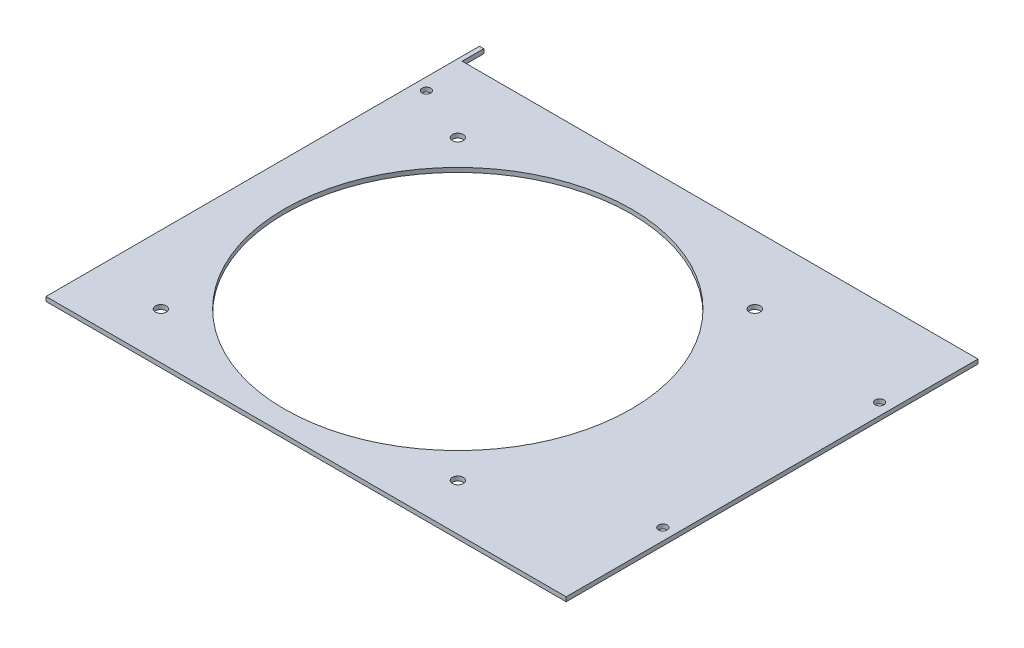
ISO-10303-21;
HEADER;
FILE_DESCRIPTION(('STEP AP214'),'2;1');
FILE_NAME('part.step','',(''),(''),'','','');
FILE_SCHEMA(('AUTOMOTIVE_DESIGN { 1 0 10303 214 1 1 1 1 }'));
ENDSEC;
DATA;
#1=APPLICATION_CONTEXT('core data for automotive mechanical design processes');
#2=APPLICATION_PROTOCOL_DEFINITION('international standard','automotive_design',2000,#1);
#3=PRODUCT_CONTEXT('',#1,'mechanical');
#4=PRODUCT('Part','Part','',(#3));
#5=PRODUCT_RELATED_PRODUCT_CATEGORY('part','',(#4));
#6=PRODUCT_DEFINITION_FORMATION('','',#4);
#7=PRODUCT_DEFINITION_CONTEXT('part definition',#1,'design');
#8=PRODUCT_DEFINITION('design','',#6,#7);
#9=PRODUCT_DEFINITION_SHAPE('','',#8);
#10=(LENGTH_UNIT() NAMED_UNIT(*) SI_UNIT(.MILLI.,.METRE.));
#11=(NAMED_UNIT(*) PLANE_ANGLE_UNIT() SI_UNIT($,.RADIAN.));
#12=(NAMED_UNIT(*) SI_UNIT($,.STERADIAN.) SOLID_ANGLE_UNIT());
#13=UNCERTAINTY_MEASURE_WITH_UNIT(LENGTH_MEASURE(1.E-05),#10,'distance_accuracy_value','');
#14=(GEOMETRIC_REPRESENTATION_CONTEXT(3) GLOBAL_UNCERTAINTY_ASSIGNED_CONTEXT((#13)) GLOBAL_UNIT_ASSIGNED_CONTEXT((#10,
#11,#12)) REPRESENTATION_CONTEXT('',''));
#15=CARTESIAN_POINT('',(0.,0.,0.));
#16=DIRECTION('',(0.,0.,1.));
#17=DIRECTION('',(1.,0.,0.));
#18=AXIS2_PLACEMENT_3D('',#15,#16,#17);
#19=CARTESIAN_POINT('',(0.,2.54,-34.5045662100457));
#20=DIRECTION('',(0.,0.,1.));
#21=DIRECTION('',(1.,0.,0.));
#22=AXIS2_PLACEMENT_3D('',#19,#20,#21);
#23=PLANE('',#22);
#24=DIRECTION('',(-1.,0.,0.));
#25=VECTOR('',#24,1.);
#26=CARTESIAN_POINT('',(0.,2.54,-34.5045662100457));
#27=LINE('',#26,#25);
#28=CARTESIAN_POINT('',(-251.46,2.54,-34.5045662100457));
#29=VERTEX_POINT('',#28);
#30=CARTESIAN_POINT('',(-254.,2.54,-34.5045662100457));
#31=VERTEX_POINT('',#30);
#32=EDGE_CURVE('E202',#29,#31,#27,.T.);
#33=ORIENTED_EDGE('',*,*,#32,.F.);
#34=DIRECTION('',(0.,1.,0.));
#35=VECTOR('',#34,1.);
#36=CARTESIAN_POINT('',(-251.46,-73.66,-34.5045662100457));
#37=LINE('',#36,#35);
#38=CARTESIAN_POINT('',(-251.46,0.,-34.5045662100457));
#39=VERTEX_POINT('',#38);
#40=EDGE_CURVE('E162',#39,#29,#37,.T.);
#41=ORIENTED_EDGE('',*,*,#40,.F.);
#42=DIRECTION('',(-1.,0.,0.));
#43=VECTOR('',#42,1.);
#44=CARTESIAN_POINT('',(0.,0.,-34.5045662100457));
#45=LINE('',#44,#43);
#46=CARTESIAN_POINT('',(-254.,0.,-34.5045662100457));
#47=VERTEX_POINT('',#46);
#48=EDGE_CURVE('E99',#39,#47,#45,.T.);
#49=ORIENTED_EDGE('',*,*,#48,.T.);
#50=DIRECTION('',(0.,-1.,0.));
#51=VECTOR('',#50,1.);
#52=CARTESIAN_POINT('',(-254.,2.54,-34.5045662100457));
#53=LINE('',#52,#51);
#54=EDGE_CURVE('E140',#31,#47,#53,.T.);
#55=ORIENTED_EDGE('',*,*,#54,.F.);
#56=EDGE_LOOP('',(#33,#41,#49,#55));
#57=FACE_BOUND('',#56,.T.);
#58=ADVANCED_FACE('F77',(#57),#23,.F.);
#59=CARTESIAN_POINT('',(-254.,2.54,219.495433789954));
#60=DIRECTION('',(1.,0.,0.));
#61=DIRECTION('',(0.,0.,-1.));
#62=AXIS2_PLACEMENT_3D('',#59,#60,#61);
#63=PLANE('',#62);
#64=DIRECTION('',(0.,0.,1.));
#65=VECTOR('',#64,1.);
#66=CARTESIAN_POINT('',(-254.,2.54,219.495433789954));
#67=LINE('',#66,#65);
#68=CARTESIAN_POINT('',(-254.,2.54,219.495433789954));
#69=VERTEX_POINT('',#68);
#70=EDGE_CURVE('E175',#31,#69,#67,.T.);
#71=ORIENTED_EDGE('',*,*,#70,.F.);
#72=ORIENTED_EDGE('',*,*,#54,.T.);
#73=DIRECTION('',(0.,0.,1.));
#74=VECTOR('',#73,1.);
#75=CARTESIAN_POINT('',(-254.,0.,219.495433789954));
#76=LINE('',#75,#74);
#77=CARTESIAN_POINT('',(-254.,0.,219.495433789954));
#78=VERTEX_POINT('',#77);
#79=EDGE_CURVE('E206',#47,#78,#76,.T.);
#80=ORIENTED_EDGE('',*,*,#79,.T.);
#81=DIRECTION('',(0.,-1.,0.));
#82=VECTOR('',#81,1.);
#83=CARTESIAN_POINT('',(-254.,2.54,219.495433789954));
#84=LINE('',#83,#82);
#85=EDGE_CURVE('E91',#69,#78,#84,.T.);
#86=ORIENTED_EDGE('',*,*,#85,.F.);
#87=EDGE_LOOP('',(#71,#72,#80,#86));
#88=FACE_BOUND('',#87,.T.);
#89=ADVANCED_FACE('F251',(#88),#63,.F.);
#90=CARTESIAN_POINT('',(0.,2.54,219.495433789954));
#91=DIRECTION('',(0.,0.,-1.));
#92=DIRECTION('',(-1.,0.,0.));
#93=AXIS2_PLACEMENT_3D('',#90,#91,#92);
#94=PLANE('',#93);
#95=DIRECTION('',(1.,0.,0.));
#96=VECTOR('',#95,1.);
#97=CARTESIAN_POINT('',(0.,0.,219.495433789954));
#98=LINE('',#97,#96);
#99=CARTESIAN_POINT('',(50.8000000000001,0.,219.495433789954));
#100=VERTEX_POINT('',#99);
#101=EDGE_CURVE('E204',#78,#100,#98,.T.);
#102=ORIENTED_EDGE('',*,*,#101,.T.);
#103=DIRECTION('',(0.,1.,0.));
#104=VECTOR('',#103,1.);
#105=CARTESIAN_POINT('',(50.8000000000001,0.,219.495433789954));
#106=LINE('',#105,#104);
#107=CARTESIAN_POINT('',(50.8000000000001,2.54,219.495433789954));
#108=VERTEX_POINT('',#107);
#109=EDGE_CURVE('E148',#100,#108,#106,.T.);
#110=ORIENTED_EDGE('',*,*,#109,.T.);
#111=DIRECTION('',(1.,0.,0.));
#112=VECTOR('',#111,1.);
#113=CARTESIAN_POINT('',(0.,2.54,219.495433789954));
#114=LINE('',#113,#112);
#115=EDGE_CURVE('E172',#69,#108,#114,.T.);
#116=ORIENTED_EDGE('',*,*,#115,.F.);
#117=ORIENTED_EDGE('',*,*,#85,.T.);
#118=EDGE_LOOP('',(#102,#110,#116,#117));
#119=FACE_BOUND('',#118,.T.);
#120=ADVANCED_FACE('F242',(#119),#94,.F.);
#121=CARTESIAN_POINT('',(-247.015,60.96,3.59543378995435));
#122=DIRECTION('',(0.,-1.,0.));
#123=DIRECTION('',(0.,0.,-1.));
#124=AXIS2_PLACEMENT_3D('',#121,#122,#123);
#125=CYLINDRICAL_SURFACE('',#124,2.53999999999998);
#126=CARTESIAN_POINT('',(-247.015,0.,3.59543378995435));
#127=DIRECTION('',(0.,1.,0.));
#128=DIRECTION('',(0.,0.,1.));
#129=AXIS2_PLACEMENT_3D('',#126,#127,#128);
#130=CIRCLE('',#129,2.53999999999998);
#131=CARTESIAN_POINT('',(-247.015,0.,1.05543378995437));
#132=VERTEX_POINT('',#131);
#133=EDGE_CURVE('E183',#132,#132,#130,.T.);
#134=CARTESIAN_POINT('',(-247.015,2.54,3.59543378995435));
#135=DIRECTION('',(0.,1.,0.));
#136=DIRECTION('',(0.,0.,1.));
#137=AXIS2_PLACEMENT_3D('',#134,#135,#136);
#138=CIRCLE('',#137,2.53999999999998);
#139=CARTESIAN_POINT('',(-247.015,2.54,1.05543378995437));
#140=VERTEX_POINT('',#139);
#141=EDGE_CURVE('E169',#140,#140,#138,.T.);
#142=CARTESIAN_POINT('',(-247.015,0.,1.05543378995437));
#143=CARTESIAN_POINT('',(-247.015,0.0264583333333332,1.05543378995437));
#144=CARTESIAN_POINT('',(-247.015,0.0529166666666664,1.05543378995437));
#145=CARTESIAN_POINT('',(-247.015,0.105833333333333,1.05543378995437));
#146=CARTESIAN_POINT('',(-247.015,0.132291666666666,1.05543378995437));
#147=CARTESIAN_POINT('',(-247.015,0.185208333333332,1.05543378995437));
#148=CARTESIAN_POINT('',(-247.015,0.211666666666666,1.05543378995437));
#149=CARTESIAN_POINT('',(-247.015,0.264583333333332,1.05543378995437));
#150=CARTESIAN_POINT('',(-247.015,0.291041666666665,1.05543378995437));
#151=CARTESIAN_POINT('',(-247.015,0.343958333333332,1.05543378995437));
#152=CARTESIAN_POINT('',(-247.015,0.370416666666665,1.05543378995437));
#153=CARTESIAN_POINT('',(-247.015,0.423333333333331,1.05543378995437));
#154=CARTESIAN_POINT('',(-247.015,0.449791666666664,1.05543378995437));
#155=CARTESIAN_POINT('',(-247.015,0.502708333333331,1.05543378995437));
#156=CARTESIAN_POINT('',(-247.015,0.529166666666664,1.05543378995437));
#157=CARTESIAN_POINT('',(-247.015,0.58208333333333,1.05543378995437));
#158=CARTESIAN_POINT('',(-247.015,0.608541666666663,1.05543378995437));
#159=CARTESIAN_POINT('',(-247.015,0.661458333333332,1.05543378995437));
#160=CARTESIAN_POINT('',(-247.015,0.687916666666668,1.05543378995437));
#161=CARTESIAN_POINT('',(-247.015,0.740833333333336,1.05543378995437));
#162=CARTESIAN_POINT('',(-247.015,0.76729166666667,1.05543378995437));
#163=CARTESIAN_POINT('',(-247.015,0.820208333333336,1.05543378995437));
#164=CARTESIAN_POINT('',(-247.015,0.846666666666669,1.05543378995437));
#165=CARTESIAN_POINT('',(-247.015,0.899583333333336,1.05543378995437));
#166=CARTESIAN_POINT('',(-247.015,0.926041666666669,1.05543378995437));
#167=CARTESIAN_POINT('',(-247.015,0.978958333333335,1.05543378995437));
#168=CARTESIAN_POINT('',(-247.015,1.00541666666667,1.05543378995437));
#169=CARTESIAN_POINT('',(-247.015,1.05833333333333,1.05543378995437));
#170=CARTESIAN_POINT('',(-247.015,1.08479166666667,1.05543378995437));
#171=CARTESIAN_POINT('',(-247.015,1.13770833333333,1.05543378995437));
#172=CARTESIAN_POINT('',(-247.015,1.16416666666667,1.05543378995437));
#173=CARTESIAN_POINT('',(-247.015,1.21708333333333,1.05543378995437));
#174=CARTESIAN_POINT('',(-247.015,1.24354166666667,1.05543378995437));
#175=CARTESIAN_POINT('',(-247.015,1.29645833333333,1.05543378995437));
#176=CARTESIAN_POINT('',(-247.015,1.32291666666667,1.05543378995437));
#177=CARTESIAN_POINT('',(-247.015,1.37583333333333,1.05543378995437));
#178=CARTESIAN_POINT('',(-247.015,1.40229166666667,1.05543378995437));
#179=CARTESIAN_POINT('',(-247.015,1.45520833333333,1.05543378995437));
#180=CARTESIAN_POINT('',(-247.015,1.48166666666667,1.05543378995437));
#181=CARTESIAN_POINT('',(-247.015,1.53458333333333,1.05543378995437));
#182=CARTESIAN_POINT('',(-247.015,1.56104166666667,1.05543378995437));
#183=CARTESIAN_POINT('',(-247.015,1.61395833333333,1.05543378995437));
#184=CARTESIAN_POINT('',(-247.015,1.64041666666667,1.05543378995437));
#185=CARTESIAN_POINT('',(-247.015,1.69333333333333,1.05543378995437));
#186=CARTESIAN_POINT('',(-247.015,1.71979166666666,1.05543378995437));
#187=CARTESIAN_POINT('',(-247.015,1.77270833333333,1.05543378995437));
#188=CARTESIAN_POINT('',(-247.015,1.79916666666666,1.05543378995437));
#189=CARTESIAN_POINT('',(-247.015,1.85208333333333,1.05543378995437));
#190=CARTESIAN_POINT('',(-247.015,1.87854166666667,1.05543378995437));
#191=CARTESIAN_POINT('',(-247.015,1.93145833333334,1.05543378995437));
#192=CARTESIAN_POINT('',(-247.015,1.95791666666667,1.05543378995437));
#193=CARTESIAN_POINT('',(-247.015,2.01083333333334,1.05543378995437));
#194=CARTESIAN_POINT('',(-247.015,2.03729166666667,1.05543378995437));
#195=CARTESIAN_POINT('',(-247.015,2.09020833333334,1.05543378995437));
#196=CARTESIAN_POINT('',(-247.015,2.11666666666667,1.05543378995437));
#197=CARTESIAN_POINT('',(-247.015,2.16958333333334,1.05543378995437));
#198=CARTESIAN_POINT('',(-247.015,2.19604166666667,1.05543378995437));
#199=CARTESIAN_POINT('',(-247.015,2.24895833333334,1.05543378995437));
#200=CARTESIAN_POINT('',(-247.015,2.27541666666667,1.05543378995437));
#201=CARTESIAN_POINT('',(-247.015,2.32833333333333,1.05543378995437));
#202=CARTESIAN_POINT('',(-247.015,2.35479166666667,1.05543378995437));
#203=CARTESIAN_POINT('',(-247.015,2.40770833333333,1.05543378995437));
#204=CARTESIAN_POINT('',(-247.015,2.43416666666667,1.05543378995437));
#205=CARTESIAN_POINT('',(-247.015,2.48708333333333,1.05543378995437));
#206=CARTESIAN_POINT('',(-247.015,2.51354166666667,1.05543378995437));
#207=CARTESIAN_POINT('',(-247.015,2.54,1.05543378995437));
#208=B_SPLINE_CURVE_WITH_KNOTS('',3,(#142,#143,#144,#145,#146,#147,#148,#149,#150,#151,#152,
#153,#154,#155,#156,#157,#158,#159,#160,#161,#162,#163,#164,#165,#166,#167,#168,#169,#170,#171,
#172,#173,#174,#175,#176,#177,#178,#179,#180,#181,#182,#183,#184,#185,#186,#187,#188,#189,#190,
#191,#192,#193,#194,#195,#196,#197,#198,#199,#200,#201,#202,#203,#204,#205,#206,#207),
.UNSPECIFIED.,.F.,.F.,(4,2,2,2,2,2,2,2,2,2,2,2,2,2,2,2,2,2,2,2,2,2,2,2,2,2,2,2,2,2,2,2,4),(0.,
0.0793749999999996,0.158749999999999,0.238124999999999,0.317499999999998,0.396874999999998,
0.476249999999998,0.555624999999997,0.634999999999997,0.714375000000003,0.793750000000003,
0.873125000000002,0.952500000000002,1.031875,1.11125,1.190625,1.27,1.349375,1.42875,1.508125,
1.5875,1.666875,1.74625,1.825625,1.905,1.984375,2.06375,2.143125,2.2225,2.301875,2.38125,
2.460625,2.54),.UNSPECIFIED.);
#209=EDGE_CURVE('BSEAM239',#132,#140,#208,.T.);
#210=ORIENTED_EDGE('',*,*,#133,.F.);
#211=ORIENTED_EDGE('',*,*,#141,.T.);
#212=ORIENTED_EDGE('',*,*,#209,.T.);
#213=ORIENTED_EDGE('',*,*,#209,.F.);
#214=EDGE_LOOP('',(#210,#212,#211,#213));
#215=FACE_BOUND('',#214,.T.);
#216=ADVANCED_FACE('F239',(#215),#125,.F.);
#217=CARTESIAN_POINT('',(43.942,60.96,28.9954337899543));
#218=DIRECTION('',(0.,-1.,0.));
#219=DIRECTION('',(0.,0.,-1.));
#220=AXIS2_PLACEMENT_3D('',#217,#218,#219);
#221=CYLINDRICAL_SURFACE('',#220,2.54);
#222=CARTESIAN_POINT('',(43.942,0.,28.9954337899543));
#223=DIRECTION('',(0.,1.,0.));
#224=DIRECTION('',(0.,0.,1.));
#225=AXIS2_PLACEMENT_3D('',#222,#223,#224);
#226=CIRCLE('',#225,2.54);
#227=CARTESIAN_POINT('',(43.942,0.,26.4554337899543));
#228=VERTEX_POINT('',#227);
#229=EDGE_CURVE('E180',#228,#228,#226,.T.);
#230=CARTESIAN_POINT('',(43.942,2.54,28.9954337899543));
#231=DIRECTION('',(0.,1.,0.));
#232=DIRECTION('',(0.,0.,1.));
#233=AXIS2_PLACEMENT_3D('',#230,#231,#232);
#234=CIRCLE('',#233,2.54);
#235=CARTESIAN_POINT('',(43.942,2.54,26.4554337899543));
#236=VERTEX_POINT('',#235);
#237=EDGE_CURVE('E166',#236,#236,#234,.T.);
#238=CARTESIAN_POINT('',(43.942,0.,26.4554337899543));
#239=CARTESIAN_POINT('',(43.942,0.0264583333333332,26.4554337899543));
#240=CARTESIAN_POINT('',(43.942,0.0529166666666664,26.4554337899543));
#241=CARTESIAN_POINT('',(43.942,0.105833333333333,26.4554337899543));
#242=CARTESIAN_POINT('',(43.942,0.132291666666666,26.4554337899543));
#243=CARTESIAN_POINT('',(43.942,0.185208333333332,26.4554337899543));
#244=CARTESIAN_POINT('',(43.942,0.211666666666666,26.4554337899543));
#245=CARTESIAN_POINT('',(43.942,0.264583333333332,26.4554337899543));
#246=CARTESIAN_POINT('',(43.942,0.291041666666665,26.4554337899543));
#247=CARTESIAN_POINT('',(43.942,0.343958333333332,26.4554337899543));
#248=CARTESIAN_POINT('',(43.942,0.370416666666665,26.4554337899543));
#249=CARTESIAN_POINT('',(43.942,0.423333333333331,26.4554337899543));
#250=CARTESIAN_POINT('',(43.942,0.449791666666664,26.4554337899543));
#251=CARTESIAN_POINT('',(43.942,0.502708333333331,26.4554337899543));
#252=CARTESIAN_POINT('',(43.942,0.529166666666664,26.4554337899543));
#253=CARTESIAN_POINT('',(43.942,0.58208333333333,26.4554337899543));
#254=CARTESIAN_POINT('',(43.942,0.608541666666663,26.4554337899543));
#255=CARTESIAN_POINT('',(43.942,0.661458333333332,26.4554337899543));
#256=CARTESIAN_POINT('',(43.942,0.687916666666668,26.4554337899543));
#257=CARTESIAN_POINT('',(43.942,0.740833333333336,26.4554337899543));
#258=CARTESIAN_POINT('',(43.942,0.76729166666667,26.4554337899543));
#259=CARTESIAN_POINT('',(43.942,0.820208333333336,26.4554337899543));
#260=CARTESIAN_POINT('',(43.942,0.846666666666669,26.4554337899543));
#261=CARTESIAN_POINT('',(43.942,0.899583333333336,26.4554337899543));
#262=CARTESIAN_POINT('',(43.942,0.926041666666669,26.4554337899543));
#263=CARTESIAN_POINT('',(43.942,0.978958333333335,26.4554337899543));
#264=CARTESIAN_POINT('',(43.942,1.00541666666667,26.4554337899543));
#265=CARTESIAN_POINT('',(43.942,1.05833333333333,26.4554337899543));
#266=CARTESIAN_POINT('',(43.942,1.08479166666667,26.4554337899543));
#267=CARTESIAN_POINT('',(43.942,1.13770833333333,26.4554337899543));
#268=CARTESIAN_POINT('',(43.942,1.16416666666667,26.4554337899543));
#269=CARTESIAN_POINT('',(43.942,1.21708333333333,26.4554337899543));
#270=CARTESIAN_POINT('',(43.942,1.24354166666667,26.4554337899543));
#271=CARTESIAN_POINT('',(43.942,1.29645833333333,26.4554337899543));
#272=CARTESIAN_POINT('',(43.942,1.32291666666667,26.4554337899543));
#273=CARTESIAN_POINT('',(43.942,1.37583333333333,26.4554337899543));
#274=CARTESIAN_POINT('',(43.942,1.40229166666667,26.4554337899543));
#275=CARTESIAN_POINT('',(43.942,1.45520833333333,26.4554337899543));
#276=CARTESIAN_POINT('',(43.942,1.48166666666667,26.4554337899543));
#277=CARTESIAN_POINT('',(43.942,1.53458333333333,26.4554337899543));
#278=CARTESIAN_POINT('',(43.942,1.56104166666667,26.4554337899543));
#279=CARTESIAN_POINT('',(43.942,1.61395833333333,26.4554337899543));
#280=CARTESIAN_POINT('',(43.942,1.64041666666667,26.4554337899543));
#281=CARTESIAN_POINT('',(43.942,1.69333333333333,26.4554337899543));
#282=CARTESIAN_POINT('',(43.942,1.71979166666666,26.4554337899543));
#283=CARTESIAN_POINT('',(43.942,1.77270833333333,26.4554337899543));
#284=CARTESIAN_POINT('',(43.942,1.79916666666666,26.4554337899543));
#285=CARTESIAN_POINT('',(43.942,1.85208333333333,26.4554337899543));
#286=CARTESIAN_POINT('',(43.942,1.87854166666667,26.4554337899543));
#287=CARTESIAN_POINT('',(43.942,1.93145833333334,26.4554337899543));
#288=CARTESIAN_POINT('',(43.942,1.95791666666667,26.4554337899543));
#289=CARTESIAN_POINT('',(43.942,2.01083333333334,26.4554337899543));
#290=CARTESIAN_POINT('',(43.942,2.03729166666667,26.4554337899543));
#291=CARTESIAN_POINT('',(43.942,2.09020833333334,26.4554337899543));
#292=CARTESIAN_POINT('',(43.942,2.11666666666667,26.4554337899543));
#293=CARTESIAN_POINT('',(43.942,2.16958333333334,26.4554337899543));
#294=CARTESIAN_POINT('',(43.942,2.19604166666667,26.4554337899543));
#295=CARTESIAN_POINT('',(43.942,2.24895833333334,26.4554337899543));
#296=CARTESIAN_POINT('',(43.942,2.27541666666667,26.4554337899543));
#297=CARTESIAN_POINT('',(43.942,2.32833333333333,26.4554337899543));
#298=CARTESIAN_POINT('',(43.942,2.35479166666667,26.4554337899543));
#299=CARTESIAN_POINT('',(43.942,2.40770833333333,26.4554337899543));
#300=CARTESIAN_POINT('',(43.942,2.43416666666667,26.4554337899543));
#301=CARTESIAN_POINT('',(43.942,2.48708333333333,26.4554337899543));
#302=CARTESIAN_POINT('',(43.942,2.51354166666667,26.4554337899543));
#303=CARTESIAN_POINT('',(43.942,2.54,26.4554337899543));
#304=B_SPLINE_CURVE_WITH_KNOTS('',3,(#238,#239,#240,#241,#242,#243,#244,#245,#246,#247,#248,
#249,#250,#251,#252,#253,#254,#255,#256,#257,#258,#259,#260,#261,#262,#263,#264,#265,#266,#267,
#268,#269,#270,#271,#272,#273,#274,#275,#276,#277,#278,#279,#280,#281,#282,#283,#284,#285,#286,
#287,#288,#289,#290,#291,#292,#293,#294,#295,#296,#297,#298,#299,#300,#301,#302,#303),
.UNSPECIFIED.,.F.,.F.,(4,2,2,2,2,2,2,2,2,2,2,2,2,2,2,2,2,2,2,2,2,2,2,2,2,2,2,2,2,2,2,2,4),(0.,
0.0793749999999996,0.158749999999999,0.238124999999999,0.317499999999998,0.396874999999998,
0.476249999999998,0.555624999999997,0.634999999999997,0.714375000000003,0.793750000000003,
0.873125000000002,0.952500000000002,1.031875,1.11125,1.190625,1.27,1.349375,1.42875,1.508125,
1.5875,1.666875,1.74625,1.825625,1.905,1.984375,2.06375,2.143125,2.2225,2.301875,2.38125,
2.460625,2.54),.UNSPECIFIED.);
#305=EDGE_CURVE('BSEAM241',#228,#236,#304,.T.);
#306=ORIENTED_EDGE('',*,*,#229,.F.);
#307=ORIENTED_EDGE('',*,*,#237,.T.);
#308=ORIENTED_EDGE('',*,*,#305,.T.);
#309=ORIENTED_EDGE('',*,*,#305,.F.);
#310=EDGE_LOOP('',(#306,#308,#307,#309));
#311=FACE_BOUND('',#310,.T.);
#312=ADVANCED_FACE('F241',(#311),#221,.F.);
#313=CARTESIAN_POINT('',(43.942,60.96,155.995433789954));
#314=DIRECTION('',(0.,-1.,0.));
#315=DIRECTION('',(0.,0.,-1.));
#316=AXIS2_PLACEMENT_3D('',#313,#314,#315);
#317=CYLINDRICAL_SURFACE('',#316,2.54000000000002);
#318=CARTESIAN_POINT('',(43.942,0.,155.995433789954));
#319=DIRECTION('',(0.,1.,0.));
#320=DIRECTION('',(0.,0.,1.));
#321=AXIS2_PLACEMENT_3D('',#318,#319,#320);
#322=CIRCLE('',#321,2.54000000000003);
#323=CARTESIAN_POINT('',(43.942,0.,153.455433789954));
#324=VERTEX_POINT('',#323);
#325=EDGE_CURVE('E177',#324,#324,#322,.T.);
#326=CARTESIAN_POINT('',(43.942,2.54,155.995433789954));
#327=DIRECTION('',(0.,1.,0.));
#328=DIRECTION('',(0.,0.,1.));
#329=AXIS2_PLACEMENT_3D('',#326,#327,#328);
#330=CIRCLE('',#329,2.54000000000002);
#331=CARTESIAN_POINT('',(43.942,2.54,153.455433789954));
#332=VERTEX_POINT('',#331);
#333=EDGE_CURVE('E164',#332,#332,#330,.T.);
#334=CARTESIAN_POINT('',(43.942,0.,153.455433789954));
#335=CARTESIAN_POINT('',(43.942,0.0264583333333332,153.455433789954));
#336=CARTESIAN_POINT('',(43.942,0.0529166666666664,153.455433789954));
#337=CARTESIAN_POINT('',(43.942,0.105833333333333,153.455433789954));
#338=CARTESIAN_POINT('',(43.942,0.132291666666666,153.455433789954));
#339=CARTESIAN_POINT('',(43.942,0.185208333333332,153.455433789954));
#340=CARTESIAN_POINT('',(43.942,0.211666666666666,153.455433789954));
#341=CARTESIAN_POINT('',(43.942,0.264583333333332,153.455433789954));
#342=CARTESIAN_POINT('',(43.942,0.291041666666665,153.455433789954));
#343=CARTESIAN_POINT('',(43.942,0.343958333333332,153.455433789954));
#344=CARTESIAN_POINT('',(43.942,0.370416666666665,153.455433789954));
#345=CARTESIAN_POINT('',(43.942,0.423333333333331,153.455433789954));
#346=CARTESIAN_POINT('',(43.942,0.449791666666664,153.455433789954));
#347=CARTESIAN_POINT('',(43.942,0.502708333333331,153.455433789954));
#348=CARTESIAN_POINT('',(43.942,0.529166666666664,153.455433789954));
#349=CARTESIAN_POINT('',(43.942,0.58208333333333,153.455433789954));
#350=CARTESIAN_POINT('',(43.942,0.608541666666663,153.455433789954));
#351=CARTESIAN_POINT('',(43.942,0.661458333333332,153.455433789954));
#352=CARTESIAN_POINT('',(43.942,0.687916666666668,153.455433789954));
#353=CARTESIAN_POINT('',(43.942,0.740833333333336,153.455433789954));
#354=CARTESIAN_POINT('',(43.942,0.76729166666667,153.455433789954));
#355=CARTESIAN_POINT('',(43.942,0.820208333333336,153.455433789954));
#356=CARTESIAN_POINT('',(43.942,0.846666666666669,153.455433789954));
#357=CARTESIAN_POINT('',(43.942,0.899583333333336,153.455433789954));
#358=CARTESIAN_POINT('',(43.942,0.926041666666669,153.455433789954));
#359=CARTESIAN_POINT('',(43.942,0.978958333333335,153.455433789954));
#360=CARTESIAN_POINT('',(43.942,1.00541666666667,153.455433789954));
#361=CARTESIAN_POINT('',(43.942,1.05833333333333,153.455433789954));
#362=CARTESIAN_POINT('',(43.942,1.08479166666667,153.455433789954));
#363=CARTESIAN_POINT('',(43.942,1.13770833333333,153.455433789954));
#364=CARTESIAN_POINT('',(43.942,1.16416666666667,153.455433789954));
#365=CARTESIAN_POINT('',(43.942,1.21708333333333,153.455433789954));
#366=CARTESIAN_POINT('',(43.942,1.24354166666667,153.455433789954));
#367=CARTESIAN_POINT('',(43.942,1.29645833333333,153.455433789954));
#368=CARTESIAN_POINT('',(43.942,1.32291666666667,153.455433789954));
#369=CARTESIAN_POINT('',(43.942,1.37583333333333,153.455433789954));
#370=CARTESIAN_POINT('',(43.942,1.40229166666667,153.455433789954));
#371=CARTESIAN_POINT('',(43.942,1.45520833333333,153.455433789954));
#372=CARTESIAN_POINT('',(43.942,1.48166666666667,153.455433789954));
#373=CARTESIAN_POINT('',(43.942,1.53458333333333,153.455433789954));
#374=CARTESIAN_POINT('',(43.942,1.56104166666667,153.455433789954));
#375=CARTESIAN_POINT('',(43.942,1.61395833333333,153.455433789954));
#376=CARTESIAN_POINT('',(43.942,1.64041666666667,153.455433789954));
#377=CARTESIAN_POINT('',(43.942,1.69333333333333,153.455433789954));
#378=CARTESIAN_POINT('',(43.942,1.71979166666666,153.455433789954));
#379=CARTESIAN_POINT('',(43.942,1.77270833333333,153.455433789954));
#380=CARTESIAN_POINT('',(43.942,1.79916666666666,153.455433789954));
#381=CARTESIAN_POINT('',(43.942,1.85208333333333,153.455433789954));
#382=CARTESIAN_POINT('',(43.942,1.87854166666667,153.455433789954));
#383=CARTESIAN_POINT('',(43.942,1.93145833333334,153.455433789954));
#384=CARTESIAN_POINT('',(43.942,1.95791666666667,153.455433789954));
#385=CARTESIAN_POINT('',(43.942,2.01083333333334,153.455433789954));
#386=CARTESIAN_POINT('',(43.942,2.03729166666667,153.455433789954));
#387=CARTESIAN_POINT('',(43.942,2.09020833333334,153.455433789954));
#388=CARTESIAN_POINT('',(43.942,2.11666666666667,153.455433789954));
#389=CARTESIAN_POINT('',(43.942,2.16958333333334,153.455433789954));
#390=CARTESIAN_POINT('',(43.942,2.19604166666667,153.455433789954));
#391=CARTESIAN_POINT('',(43.942,2.24895833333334,153.455433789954));
#392=CARTESIAN_POINT('',(43.942,2.27541666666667,153.455433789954));
#393=CARTESIAN_POINT('',(43.942,2.32833333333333,153.455433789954));
#394=CARTESIAN_POINT('',(43.942,2.35479166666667,153.455433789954));
#395=CARTESIAN_POINT('',(43.942,2.40770833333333,153.455433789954));
#396=CARTESIAN_POINT('',(43.942,2.43416666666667,153.455433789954));
#397=CARTESIAN_POINT('',(43.942,2.48708333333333,153.455433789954));
#398=CARTESIAN_POINT('',(43.942,2.51354166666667,153.455433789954));
#399=CARTESIAN_POINT('',(43.942,2.54,153.455433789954));
#400=B_SPLINE_CURVE_WITH_KNOTS('',3,(#334,#335,#336,#337,#338,#339,#340,#341,#342,#343,#344,
#345,#346,#347,#348,#349,#350,#351,#352,#353,#354,#355,#356,#357,#358,#359,#360,#361,#362,#363,
#364,#365,#366,#367,#368,#369,#370,#371,#372,#373,#374,#375,#376,#377,#378,#379,#380,#381,#382,
#383,#384,#385,#386,#387,#388,#389,#390,#391,#392,#393,#394,#395,#396,#397,#398,#399),
.UNSPECIFIED.,.F.,.F.,(4,2,2,2,2,2,2,2,2,2,2,2,2,2,2,2,2,2,2,2,2,2,2,2,2,2,2,2,2,2,2,2,4),(0.,
0.0793749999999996,0.158749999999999,0.238124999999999,0.317499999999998,0.396874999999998,
0.476249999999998,0.555624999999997,0.634999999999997,0.714375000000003,0.793750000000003,
0.873125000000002,0.952500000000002,1.031875,1.11125,1.190625,1.27,1.349375,1.42875,1.508125,
1.5875,1.666875,1.74625,1.825625,1.905,1.984375,2.06375,2.143125,2.2225,2.301875,2.38125,
2.460625,2.54),.UNSPECIFIED.);
#401=EDGE_CURVE('BSEAM228',#324,#332,#400,.T.);
#402=ORIENTED_EDGE('',*,*,#325,.F.);
#403=ORIENTED_EDGE('',*,*,#333,.T.);
#404=ORIENTED_EDGE('',*,*,#401,.T.);
#405=ORIENTED_EDGE('',*,*,#401,.F.);
#406=EDGE_LOOP('',(#402,#404,#403,#405));
#407=FACE_BOUND('',#406,.T.);
#408=ADVANCED_FACE('F228',(#407),#317,.F.);
#409=CARTESIAN_POINT('',(0.,2.54,0.));
#410=DIRECTION('',(0.,1.,0.));
#411=DIRECTION('',(0.,0.,1.));
#412=AXIS2_PLACEMENT_3D('',#409,#410,#411);
#413=PLANE('',#412);
#414=DIRECTION('',(0.,0.,1.));
#415=VECTOR('',#414,1.);
#416=CARTESIAN_POINT('',(50.8,2.54,-21.8045662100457));
#417=LINE('',#416,#415);
#418=CARTESIAN_POINT('',(50.8,2.54,-21.8045662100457));
#419=VERTEX_POINT('',#418);
#420=EDGE_CURVE('E152',#419,#108,#417,.T.);
#421=ORIENTED_EDGE('',*,*,#420,.F.);
#422=DIRECTION('',(1.,0.,0.));
#423=VECTOR('',#422,1.);
#424=CARTESIAN_POINT('',(-251.46,2.54,-21.8045662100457));
#425=LINE('',#424,#423);
#426=CARTESIAN_POINT('',(-251.46,2.54,-21.8045662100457));
#427=VERTEX_POINT('',#426);
#428=EDGE_CURVE('E145',#427,#419,#425,.T.);
#429=ORIENTED_EDGE('',*,*,#428,.F.);
#430=DIRECTION('',(0.,0.,1.));
#431=VECTOR('',#430,1.);
#432=CARTESIAN_POINT('',(-251.46,2.54,-34.5045662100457));
#433=LINE('',#432,#431);
#434=EDGE_CURVE('E156',#29,#427,#433,.T.);
#435=ORIENTED_EDGE('',*,*,#434,.F.);
#436=ORIENTED_EDGE('',*,*,#32,.T.);
#437=ORIENTED_EDGE('',*,*,#70,.T.);
#438=ORIENTED_EDGE('',*,*,#115,.T.);
#439=EDGE_LOOP('',(#421,#429,#435,#436,#437,#438));
#440=FACE_BOUND('',#439,.T.);
#441=CARTESIAN_POINT('',(-213.995,2.54,192.190433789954));
#442=DIRECTION('',(0.,1.,0.));
#443=DIRECTION('',(0.,0.,1.));
#444=AXIS2_PLACEMENT_3D('',#441,#442,#443);
#445=CIRCLE('',#444,3.17499999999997);
#446=CARTESIAN_POINT('',(-213.995,2.54,195.365433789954));
#447=VERTEX_POINT('',#446);
#448=EDGE_CURVE('E186',#447,#447,#445,.T.);
#449=ORIENTED_EDGE('',*,*,#448,.F.);
#450=EDGE_LOOP('',(#449));
#451=FACE_BOUND('',#450,.T.);
#452=CARTESIAN_POINT('',(-40.005,2.54,192.190433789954));
#453=DIRECTION('',(0.,1.,0.));
#454=DIRECTION('',(0.,0.,1.));
#455=AXIS2_PLACEMENT_3D('',#452,#453,#454);
#456=CIRCLE('',#455,3.175);
#457=CARTESIAN_POINT('',(-40.005,2.54,195.365433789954));
#458=VERTEX_POINT('',#457);
#459=EDGE_CURVE('E194',#458,#458,#456,.T.);
#460=ORIENTED_EDGE('',*,*,#459,.F.);
#461=EDGE_LOOP('',(#460));
#462=FACE_BOUND('',#461,.T.);
#463=CARTESIAN_POINT('',(-40.0050000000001,2.54,18.2004337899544));
#464=DIRECTION('',(0.,1.,0.));
#465=DIRECTION('',(0.,0.,1.));
#466=AXIS2_PLACEMENT_3D('',#463,#464,#465);
#467=CIRCLE('',#466,3.175);
#468=CARTESIAN_POINT('',(-40.0050000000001,2.54,21.3754337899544));
#469=VERTEX_POINT('',#468);
#470=EDGE_CURVE('E191',#469,#469,#467,.T.);
#471=ORIENTED_EDGE('',*,*,#470,.F.);
#472=EDGE_LOOP('',(#471));
#473=FACE_BOUND('',#472,.T.);
#474=CARTESIAN_POINT('',(-213.995,2.54,18.2004337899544));
#475=DIRECTION('',(0.,1.,0.));
#476=DIRECTION('',(0.,0.,1.));
#477=AXIS2_PLACEMENT_3D('',#474,#475,#476);
#478=CIRCLE('',#477,3.175);
#479=CARTESIAN_POINT('',(-213.995,2.54,21.3754337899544));
#480=VERTEX_POINT('',#479);
#481=EDGE_CURVE('E187',#480,#480,#478,.T.);
#482=ORIENTED_EDGE('',*,*,#481,.F.);
#483=EDGE_LOOP('',(#482));
#484=FACE_BOUND('',#483,.T.);
#485=CARTESIAN_POINT('',(-127.,2.54,105.195433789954));
#486=DIRECTION('',(0.,1.,0.));
#487=DIRECTION('',(0.,0.,1.));
#488=AXIS2_PLACEMENT_3D('',#485,#486,#487);
#489=CIRCLE('',#488,101.6);
#490=CARTESIAN_POINT('',(-127.,2.54,206.795433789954));
#491=VERTEX_POINT('',#490);
#492=EDGE_CURVE('E190',#491,#491,#489,.T.);
#493=ORIENTED_EDGE('',*,*,#492,.F.);
#494=EDGE_LOOP('',(#493));
#495=FACE_BOUND('',#494,.T.);
#496=ORIENTED_EDGE('',*,*,#333,.F.);
#497=EDGE_LOOP('',(#496));
#498=FACE_BOUND('',#497,.T.);
#499=ORIENTED_EDGE('',*,*,#237,.F.);
#500=EDGE_LOOP('',(#499));
#501=FACE_BOUND('',#500,.T.);
#502=ORIENTED_EDGE('',*,*,#141,.F.);
#503=EDGE_LOOP('',(#502));
#504=FACE_BOUND('',#503,.T.);
#505=ADVANCED_FACE('F230',(#440,#451,#462,#473,#484,#495,#498,#501,#504),#413,.T.);
#506=CARTESIAN_POINT('',(0.,0.,0.));
#507=DIRECTION('',(0.,1.,0.));
#508=DIRECTION('',(0.,0.,1.));
#509=AXIS2_PLACEMENT_3D('',#506,#507,#508);
#510=PLANE('',#509);
#511=DIRECTION('',(1.,0.,0.));
#512=VECTOR('',#511,1.);
#513=CARTESIAN_POINT('',(0.,0.,-21.8045662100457));
#514=LINE('',#513,#512);
#515=CARTESIAN_POINT('',(-251.46,0.,-21.8045662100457));
#516=VERTEX_POINT('',#515);
#517=CARTESIAN_POINT('',(50.8,0.,-21.8045662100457));
#518=VERTEX_POINT('',#517);
#519=EDGE_CURVE('E84',#516,#518,#514,.T.);
#520=ORIENTED_EDGE('',*,*,#519,.T.);
#521=DIRECTION('',(0.,0.,1.));
#522=VECTOR('',#521,1.);
#523=CARTESIAN_POINT('',(50.8,0.,-21.8045662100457));
#524=LINE('',#523,#522);
#525=EDGE_CURVE('E137',#518,#100,#524,.T.);
#526=ORIENTED_EDGE('',*,*,#525,.T.);
#527=ORIENTED_EDGE('',*,*,#101,.F.);
#528=ORIENTED_EDGE('',*,*,#79,.F.);
#529=ORIENTED_EDGE('',*,*,#48,.F.);
#530=DIRECTION('',(0.,0.,1.));
#531=VECTOR('',#530,1.);
#532=CARTESIAN_POINT('',(-251.46,0.,0.));
#533=LINE('',#532,#531);
#534=EDGE_CURVE('E12',#39,#516,#533,.T.);
#535=ORIENTED_EDGE('',*,*,#534,.T.);
#536=EDGE_LOOP('',(#520,#526,#527,#528,#529,#535));
#537=FACE_BOUND('',#536,.T.);
#538=ORIENTED_EDGE('',*,*,#133,.T.);
#539=EDGE_LOOP('',(#538));
#540=FACE_BOUND('',#539,.T.);
#541=ORIENTED_EDGE('',*,*,#229,.T.);
#542=EDGE_LOOP('',(#541));
#543=FACE_BOUND('',#542,.T.);
#544=ORIENTED_EDGE('',*,*,#325,.T.);
#545=EDGE_LOOP('',(#544));
#546=FACE_BOUND('',#545,.T.);
#547=CARTESIAN_POINT('',(-213.995,0.,192.190433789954));
#548=DIRECTION('',(0.,1.,0.));
#549=DIRECTION('',(0.,0.,1.));
#550=AXIS2_PLACEMENT_3D('',#547,#548,#549);
#551=CIRCLE('',#550,3.17499999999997);
#552=CARTESIAN_POINT('',(-213.995,0.,195.365433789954));
#553=VERTEX_POINT('',#552);
#554=EDGE_CURVE('E207',#553,#553,#551,.T.);
#555=ORIENTED_EDGE('',*,*,#554,.T.);
#556=EDGE_LOOP('',(#555));
#557=FACE_BOUND('',#556,.T.);
#558=CARTESIAN_POINT('',(-40.005,0.,192.190433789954));
#559=DIRECTION('',(0.,1.,0.));
#560=DIRECTION('',(0.,0.,1.));
#561=AXIS2_PLACEMENT_3D('',#558,#559,#560);
#562=CIRCLE('',#561,3.175);
#563=CARTESIAN_POINT('',(-40.005,0.,195.365433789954));
#564=VERTEX_POINT('',#563);
#565=EDGE_CURVE('E220',#564,#564,#562,.T.);
#566=ORIENTED_EDGE('',*,*,#565,.T.);
#567=EDGE_LOOP('',(#566));
#568=FACE_BOUND('',#567,.T.);
#569=CARTESIAN_POINT('',(-40.0050000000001,0.,18.2004337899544));
#570=DIRECTION('',(0.,1.,0.));
#571=DIRECTION('',(0.,0.,1.));
#572=AXIS2_PLACEMENT_3D('',#569,#570,#571);
#573=CIRCLE('',#572,3.175);
#574=CARTESIAN_POINT('',(-40.0050000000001,0.,21.3754337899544));
#575=VERTEX_POINT('',#574);
#576=EDGE_CURVE('E217',#575,#575,#573,.T.);
#577=ORIENTED_EDGE('',*,*,#576,.T.);
#578=EDGE_LOOP('',(#577));
#579=FACE_BOUND('',#578,.T.);
#580=CARTESIAN_POINT('',(-213.995,0.,18.2004337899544));
#581=DIRECTION('',(0.,1.,0.));
#582=DIRECTION('',(0.,0.,1.));
#583=AXIS2_PLACEMENT_3D('',#580,#581,#582);
#584=CIRCLE('',#583,3.175);
#585=CARTESIAN_POINT('',(-213.995,0.,21.3754337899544));
#586=VERTEX_POINT('',#585);
#587=EDGE_CURVE('E214',#586,#586,#584,.T.);
#588=ORIENTED_EDGE('',*,*,#587,.T.);
#589=EDGE_LOOP('',(#588));
#590=FACE_BOUND('',#589,.T.);
#591=CARTESIAN_POINT('',(-127.,0.,105.195433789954));
#592=DIRECTION('',(0.,1.,0.));
#593=DIRECTION('',(0.,0.,1.));
#594=AXIS2_PLACEMENT_3D('',#591,#592,#593);
#595=CIRCLE('',#594,101.6);
#596=CARTESIAN_POINT('',(-127.,0.,206.795433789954));
#597=VERTEX_POINT('',#596);
#598=EDGE_CURVE('E201',#597,#597,#595,.T.);
#599=ORIENTED_EDGE('',*,*,#598,.T.);
#600=EDGE_LOOP('',(#599));
#601=FACE_BOUND('',#600,.T.);
#602=ADVANCED_FACE('F133',(#537,#540,#543,#546,#557,#568,#579,#590,#601),#510,.F.);
#603=CARTESIAN_POINT('',(-127.,-48.26,105.195433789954));
#604=DIRECTION('',(0.,1.,0.));
#605=DIRECTION('',(0.,0.,1.));
#606=AXIS2_PLACEMENT_3D('',#603,#604,#605);
#607=CYLINDRICAL_SURFACE('',#606,101.6);
#608=ORIENTED_EDGE('',*,*,#492,.T.);
#609=EDGE_LOOP('',(#608));
#610=FACE_BOUND('',#609,.T.);
#611=ORIENTED_EDGE('',*,*,#598,.F.);
#612=EDGE_LOOP('',(#611));
#613=FACE_BOUND('',#612,.T.);
#614=ADVANCED_FACE('F288',(#610,#613),#607,.F.);
#615=CARTESIAN_POINT('',(-213.995,-48.26,18.2004337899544));
#616=DIRECTION('',(0.,1.,0.));
#617=DIRECTION('',(0.,0.,1.));
#618=AXIS2_PLACEMENT_3D('',#615,#616,#617);
#619=CYLINDRICAL_SURFACE('',#618,3.175);
#620=ORIENTED_EDGE('',*,*,#481,.T.);
#621=EDGE_LOOP('',(#620));
#622=FACE_BOUND('',#621,.T.);
#623=ORIENTED_EDGE('',*,*,#587,.F.);
#624=EDGE_LOOP('',(#623));
#625=FACE_BOUND('',#624,.T.);
#626=ADVANCED_FACE('F301',(#622,#625),#619,.F.);
#627=CARTESIAN_POINT('',(-40.0050000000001,-48.26,18.2004337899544));
#628=DIRECTION('',(0.,1.,0.));
#629=DIRECTION('',(0.,0.,1.));
#630=AXIS2_PLACEMENT_3D('',#627,#628,#629);
#631=CYLINDRICAL_SURFACE('',#630,3.175);
#632=ORIENTED_EDGE('',*,*,#470,.T.);
#633=EDGE_LOOP('',(#632));
#634=FACE_BOUND('',#633,.T.);
#635=ORIENTED_EDGE('',*,*,#576,.F.);
#636=EDGE_LOOP('',(#635));
#637=FACE_BOUND('',#636,.T.);
#638=ADVANCED_FACE('F307',(#634,#637),#631,.F.);
#639=CARTESIAN_POINT('',(-40.005,-48.26,192.190433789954));
#640=DIRECTION('',(0.,1.,0.));
#641=DIRECTION('',(0.,0.,1.));
#642=AXIS2_PLACEMENT_3D('',#639,#640,#641);
#643=CYLINDRICAL_SURFACE('',#642,3.175);
#644=ORIENTED_EDGE('',*,*,#459,.T.);
#645=EDGE_LOOP('',(#644));
#646=FACE_BOUND('',#645,.T.);
#647=ORIENTED_EDGE('',*,*,#565,.F.);
#648=EDGE_LOOP('',(#647));
#649=FACE_BOUND('',#648,.T.);
#650=ADVANCED_FACE('F275',(#646,#649),#643,.F.);
#651=CARTESIAN_POINT('',(-213.995,-48.26,192.190433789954));
#652=DIRECTION('',(0.,1.,0.));
#653=DIRECTION('',(0.,0.,1.));
#654=AXIS2_PLACEMENT_3D('',#651,#652,#653);
#655=CYLINDRICAL_SURFACE('',#654,3.17499999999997);
#656=ORIENTED_EDGE('',*,*,#448,.T.);
#657=EDGE_LOOP('',(#656));
#658=FACE_BOUND('',#657,.T.);
#659=ORIENTED_EDGE('',*,*,#554,.F.);
#660=EDGE_LOOP('',(#659));
#661=FACE_BOUND('',#660,.T.);
#662=ADVANCED_FACE('F268',(#658,#661),#655,.F.);
#663=CARTESIAN_POINT('',(-251.46,-73.66,-34.5045662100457));
#664=DIRECTION('',(-1.,0.,0.));
#665=DIRECTION('',(0.,0.,1.));
#666=AXIS2_PLACEMENT_3D('',#663,#664,#665);
#667=PLANE('',#666);
#668=ORIENTED_EDGE('',*,*,#40,.T.);
#669=ORIENTED_EDGE('',*,*,#434,.T.);
#670=DIRECTION('',(0.,1.,0.));
#671=VECTOR('',#670,1.);
#672=CARTESIAN_POINT('',(-251.46,-73.66,-21.8045662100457));
#673=LINE('',#672,#671);
#674=EDGE_CURVE('E161',#516,#427,#673,.T.);
#675=ORIENTED_EDGE('',*,*,#674,.F.);
#676=ORIENTED_EDGE('',*,*,#534,.F.);
#677=EDGE_LOOP('',(#668,#669,#675,#676));
#678=FACE_BOUND('',#677,.T.);
#679=ADVANCED_FACE('F266',(#678),#667,.F.);
#680=CARTESIAN_POINT('',(-251.46,-73.66,-21.8045662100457));
#681=DIRECTION('',(0.,0.,1.));
#682=DIRECTION('',(1.,0.,0.));
#683=AXIS2_PLACEMENT_3D('',#680,#681,#682);
#684=PLANE('',#683);
#685=ORIENTED_EDGE('',*,*,#674,.T.);
#686=ORIENTED_EDGE('',*,*,#428,.T.);
#687=DIRECTION('',(0.,1.,0.));
#688=VECTOR('',#687,1.);
#689=CARTESIAN_POINT('',(50.8,0.,-21.8045662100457));
#690=LINE('',#689,#688);
#691=EDGE_CURVE('E142',#518,#419,#690,.T.);
#692=ORIENTED_EDGE('',*,*,#691,.F.);
#693=ORIENTED_EDGE('',*,*,#519,.F.);
#694=EDGE_LOOP('',(#685,#686,#692,#693));
#695=FACE_BOUND('',#694,.T.);
#696=ADVANCED_FACE('F143',(#695),#684,.F.);
#697=CARTESIAN_POINT('',(50.8,0.,-21.8045662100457));
#698=DIRECTION('',(-1.,0.,0.));
#699=DIRECTION('',(0.,0.,1.));
#700=AXIS2_PLACEMENT_3D('',#697,#698,#699);
#701=PLANE('',#700);
#702=ORIENTED_EDGE('',*,*,#420,.T.);
#703=ORIENTED_EDGE('',*,*,#109,.F.);
#704=ORIENTED_EDGE('',*,*,#525,.F.);
#705=ORIENTED_EDGE('',*,*,#691,.T.);
#706=EDGE_LOOP('',(#702,#703,#704,#705));
#707=FACE_BOUND('',#706,.T.);
#708=ADVANCED_FACE('F150',(#707),#701,.F.);
#709=CLOSED_SHELL('',(#58,#89,#120,#216,#312,#408,#505,#602,#614,#626,#638,#650,#662,#679,#696,#708));
#710=MANIFOLD_SOLID_BREP('B2',#709);
#711=ADVANCED_BREP_SHAPE_REPRESENTATION('',(#18,#710),#14);
#712=SHAPE_DEFINITION_REPRESENTATION(#9,#711);
ENDSEC;
END-ISO-10303-21;
